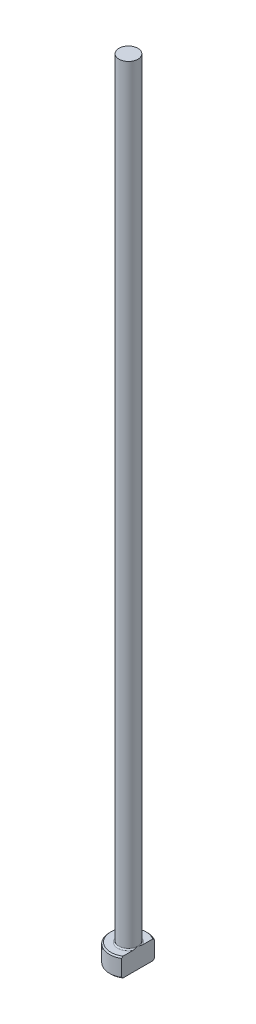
ISO-10303-21;
HEADER;
FILE_DESCRIPTION(('STEP AP214'),'2;1');
FILE_NAME('part.step','',(''),(''),'','','');
FILE_SCHEMA(('AUTOMOTIVE_DESIGN { 1 0 10303 214 1 1 1 1 }'));
ENDSEC;
DATA;
#1=APPLICATION_CONTEXT('core data for automotive mechanical design processes');
#2=APPLICATION_PROTOCOL_DEFINITION('international standard','automotive_design',2000,#1);
#3=PRODUCT_CONTEXT('',#1,'mechanical');
#4=PRODUCT('Part','Part','',(#3));
#5=PRODUCT_RELATED_PRODUCT_CATEGORY('part','',(#4));
#6=PRODUCT_DEFINITION_FORMATION('','',#4);
#7=PRODUCT_DEFINITION_CONTEXT('part definition',#1,'design');
#8=PRODUCT_DEFINITION('design','',#6,#7);
#9=PRODUCT_DEFINITION_SHAPE('','',#8);
#10=(LENGTH_UNIT() NAMED_UNIT(*) SI_UNIT(.MILLI.,.METRE.));
#11=(NAMED_UNIT(*) PLANE_ANGLE_UNIT() SI_UNIT($,.RADIAN.));
#12=(NAMED_UNIT(*) SI_UNIT($,.STERADIAN.) SOLID_ANGLE_UNIT());
#13=UNCERTAINTY_MEASURE_WITH_UNIT(LENGTH_MEASURE(1.E-05),#10,'distance_accuracy_value','');
#14=(GEOMETRIC_REPRESENTATION_CONTEXT(3) GLOBAL_UNCERTAINTY_ASSIGNED_CONTEXT((#13)) GLOBAL_UNIT_ASSIGNED_CONTEXT((#10,
#11,#12)) REPRESENTATION_CONTEXT('',''));
#15=CARTESIAN_POINT('',(0.,0.,0.));
#16=DIRECTION('',(0.,0.,1.));
#17=DIRECTION('',(1.,0.,0.));
#18=AXIS2_PLACEMENT_3D('',#15,#16,#17);
#19=CARTESIAN_POINT('',(0.,0.,0.));
#20=DIRECTION('',(0.,-1.,0.));
#21=DIRECTION('',(0.,0.,-1.));
#22=AXIS2_PLACEMENT_3D('',#19,#20,#21);
#23=PLANE('',#22);
#24=CARTESIAN_POINT('',(0.,0.,0.));
#25=DIRECTION('',(0.,-1.,0.));
#26=DIRECTION('',(0.,0.,-1.));
#27=AXIS2_PLACEMENT_3D('',#24,#25,#26);
#28=CIRCLE('',#27,2.79999999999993);
#29=CARTESIAN_POINT('',(1.49999999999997,0.,2.36431808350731));
#30=VERTEX_POINT('',#29);
#31=CARTESIAN_POINT('',(1.49999999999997,0.,-2.36431808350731));
#32=VERTEX_POINT('',#31);
#33=EDGE_CURVE('E98',#30,#32,#28,.T.);
#34=ORIENTED_EDGE('',*,*,#33,.T.);
#35=DIRECTION('',(0.,0.,1.));
#36=VECTOR('',#35,1.);
#37=CARTESIAN_POINT('',(1.49999999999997,0.,-2.5980762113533));
#38=LINE('',#37,#36);
#39=EDGE_CURVE('E83',#32,#30,#38,.T.);
#40=ORIENTED_EDGE('',*,*,#39,.T.);
#41=EDGE_LOOP('',(#34,#40));
#42=FACE_BOUND('',#41,.T.);
#43=ADVANCED_FACE('F32',(#42),#23,.T.);
#44=CARTESIAN_POINT('',(0.,259.958771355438,0.));
#45=DIRECTION('',(0.,1.,0.));
#46=DIRECTION('',(0.,0.,1.));
#47=AXIS2_PLACEMENT_3D('',#44,#45,#46);
#48=CYLINDRICAL_SURFACE('',#47,2.99999999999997);
#49=CARTESIAN_POINT('',(0.,2.80000000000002,0.));
#50=DIRECTION('',(0.,1.,0.));
#51=DIRECTION('',(0.,0.,1.));
#52=AXIS2_PLACEMENT_3D('',#49,#50,#51);
#53=CIRCLE('',#52,2.99999999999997);
#54=CARTESIAN_POINT('',(1.49999999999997,2.80000000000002,2.5980762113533));
#55=VERTEX_POINT('',#54);
#56=CARTESIAN_POINT('',(1.49999999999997,2.80000000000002,-2.5980762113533));
#57=VERTEX_POINT('',#56);
#58=EDGE_CURVE('E104',#55,#57,#53,.F.);
#59=ORIENTED_EDGE('',*,*,#58,.T.);
#60=DIRECTION('',(0.,-1.,0.));
#61=VECTOR('',#60,1.);
#62=CARTESIAN_POINT('',(1.49999999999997,125.,-2.5980762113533));
#63=LINE('',#62,#61);
#64=CARTESIAN_POINT('',(1.49999999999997,0.200000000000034,-2.5980762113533));
#65=VERTEX_POINT('',#64);
#66=EDGE_CURVE('E183',#57,#65,#63,.T.);
#67=ORIENTED_EDGE('',*,*,#66,.T.);
#68=CARTESIAN_POINT('',(0.,0.200000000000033,0.));
#69=DIRECTION('',(0.,-1.,0.));
#70=DIRECTION('',(0.,0.,-1.));
#71=AXIS2_PLACEMENT_3D('',#68,#69,#70);
#72=CIRCLE('',#71,2.99999999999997);
#73=CARTESIAN_POINT('',(1.49999999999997,0.200000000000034,2.5980762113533));
#74=VERTEX_POINT('',#73);
#75=EDGE_CURVE('E100',#65,#74,#72,.F.);
#76=ORIENTED_EDGE('',*,*,#75,.T.);
#77=DIRECTION('',(0.,-1.,0.));
#78=VECTOR('',#77,1.);
#79=CARTESIAN_POINT('',(1.49999999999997,125.,2.5980762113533));
#80=LINE('',#79,#78);
#81=EDGE_CURVE('E93',#55,#74,#80,.T.);
#82=ORIENTED_EDGE('',*,*,#81,.F.);
#83=EDGE_LOOP('',(#59,#67,#76,#82));
#84=FACE_BOUND('',#83,.T.);
#85=ADVANCED_FACE('F158',(#84),#48,.T.);
#86=CARTESIAN_POINT('',(-2.99999999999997,3.,0.));
#87=DIRECTION('',(0.,1.,0.));
#88=DIRECTION('',(0.,0.,1.));
#89=AXIS2_PLACEMENT_3D('',#86,#87,#88);
#90=PLANE('',#89);
#91=CARTESIAN_POINT('',(0.,3.,0.));
#92=DIRECTION('',(0.,1.,0.));
#93=DIRECTION('',(0.,0.,1.));
#94=AXIS2_PLACEMENT_3D('',#91,#92,#93);
#95=CIRCLE('',#94,2.79999999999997);
#96=CARTESIAN_POINT('',(1.49999999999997,3.,-2.36431808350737));
#97=VERTEX_POINT('',#96);
#98=CARTESIAN_POINT('',(1.49999999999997,3.,2.36431808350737));
#99=VERTEX_POINT('',#98);
#100=EDGE_CURVE('E178',#97,#99,#95,.T.);
#101=ORIENTED_EDGE('',*,*,#100,.T.);
#102=DIRECTION('',(0.,0.,-1.));
#103=VECTOR('',#102,1.);
#104=CARTESIAN_POINT('',(1.49999999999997,3.,0.));
#105=LINE('',#104,#103);
#106=CARTESIAN_POINT('',(1.49999999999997,2.99999999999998,0.799999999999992));
#107=VERTEX_POINT('',#106);
#108=EDGE_CURVE('E57',#99,#107,#105,.T.);
#109=ORIENTED_EDGE('',*,*,#108,.T.);
#110=CARTESIAN_POINT('',(0.,3.,0.));
#111=DIRECTION('',(0.,1.,0.));
#112=DIRECTION('',(0.,0.,1.));
#113=AXIS2_PLACEMENT_3D('',#110,#111,#112);
#114=CIRCLE('',#113,1.69999999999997);
#115=CARTESIAN_POINT('',(1.49999999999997,2.99999999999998,-0.799999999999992));
#116=VERTEX_POINT('',#115);
#117=EDGE_CURVE('E107',#107,#116,#114,.F.);
#118=ORIENTED_EDGE('',*,*,#117,.T.);
#119=EDGE_CURVE('E136',#116,#97,#105,.T.);
#120=ORIENTED_EDGE('',*,*,#119,.T.);
#121=EDGE_LOOP('',(#101,#109,#118,#120));
#122=FACE_BOUND('',#121,.T.);
#123=ADVANCED_FACE('F147',(#122),#90,.T.);
#124=CARTESIAN_POINT('',(0.,3.,0.));
#125=DIRECTION('',(0.,-1.,0.));
#126=DIRECTION('',(0.,0.,-1.));
#127=AXIS2_PLACEMENT_3D('',#124,#125,#126);
#128=CONICAL_SURFACE('',#127,2.79999999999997,0.7853981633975);
#129=ORIENTED_EDGE('',*,*,#58,.F.);
#130=CARTESIAN_POINT('',(1.49999999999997,-0.11174109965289,5.71827621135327));
#131=CARTESIAN_POINT('',(1.49999999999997,0.0136183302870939,5.58866816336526));
#132=CARTESIAN_POINT('',(1.49999999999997,0.138843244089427,5.45892957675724));
#133=CARTESIAN_POINT('',(1.49999999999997,0.388944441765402,5.19911365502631));
#134=CARTESIAN_POINT('',(1.49999999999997,0.513820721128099,5.06903631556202));
#135=CARTESIAN_POINT('',(1.49999999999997,0.763205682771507,4.8084018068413));
#136=CARTESIAN_POINT('',(1.49999999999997,0.887714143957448,4.67784442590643));
#137=CARTESIAN_POINT('',(1.49999999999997,1.13618059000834,4.41620813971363));
#138=CARTESIAN_POINT('',(1.49999999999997,1.2601385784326,4.28512923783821));
#139=CARTESIAN_POINT('',(1.49999999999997,1.50488975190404,4.02490837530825));
#140=CARTESIAN_POINT('',(1.49999999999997,1.6256969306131,3.89577958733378));
#141=CARTESIAN_POINT('',(1.49999999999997,1.86640694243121,3.63668213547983));
#142=CARTESIAN_POINT('',(1.49999999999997,1.98630978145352,3.5067134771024));
#143=CARTESIAN_POINT('',(1.49999999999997,2.22486033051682,3.24567921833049));
#144=CARTESIAN_POINT('',(1.49999999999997,2.34350830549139,3.11461386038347));
#145=CARTESIAN_POINT('',(1.49999999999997,2.57907716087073,2.85094268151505));
#146=CARTESIAN_POINT('',(1.49999999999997,2.69599811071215,2.71833692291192));
#147=CARTESIAN_POINT('',(1.49999999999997,2.88262371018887,2.50255231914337));
#148=CARTESIAN_POINT('',(1.49999999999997,2.95312454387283,2.42006293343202));
#149=CARTESIAN_POINT('',(1.49999999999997,3.09287098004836,2.25401084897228));
#150=CARTESIAN_POINT('',(1.49999999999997,3.16211645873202,2.170448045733));
#151=CARTESIAN_POINT('',(1.49999999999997,3.2996468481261,2.00105967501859));
#152=CARTESIAN_POINT('',(1.49999999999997,3.36791386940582,1.91521952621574));
#153=CARTESIAN_POINT('',(1.49999999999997,3.50205840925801,1.74171392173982));
#154=CARTESIAN_POINT('',(1.49999999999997,3.56793649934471,1.65404891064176));
#155=CARTESIAN_POINT('',(1.49999999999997,3.69728151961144,1.47490236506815));
#156=CARTESIAN_POINT('',(1.49999999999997,3.76069661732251,1.38338308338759));
#157=CARTESIAN_POINT('',(1.49999999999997,3.88239539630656,1.1967566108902));
#158=CARTESIAN_POINT('',(1.49999999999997,3.94067201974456,1.10164473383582));
#159=CARTESIAN_POINT('',(1.49999999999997,4.0484132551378,0.908008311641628));
#160=CARTESIAN_POINT('',(1.49999999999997,4.09797809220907,0.809540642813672));
#161=CARTESIAN_POINT('',(1.49999999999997,4.18432188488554,0.607192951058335));
#162=CARTESIAN_POINT('',(1.49999999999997,4.22114374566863,0.503332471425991));
#163=CARTESIAN_POINT('',(1.49999999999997,4.26099935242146,0.347577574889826));
#164=CARTESIAN_POINT('',(1.49999999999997,4.27157029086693,0.29760995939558));
#165=CARTESIAN_POINT('',(1.49999999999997,4.28794860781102,0.196885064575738));
#166=CARTESIAN_POINT('',(1.49999999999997,4.29375640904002,0.146127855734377));
#167=CARTESIAN_POINT('',(1.49999999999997,4.30019707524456,0.0444388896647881));
#168=CARTESIAN_POINT('',(1.49999999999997,4.30084594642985,-0.00649183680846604));
#169=CARTESIAN_POINT('',(1.49999999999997,4.29696416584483,-0.108155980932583));
#170=CARTESIAN_POINT('',(1.49999999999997,4.29243308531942,-0.158889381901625));
#171=CARTESIAN_POINT('',(1.49999999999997,4.27856915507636,-0.259234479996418));
#172=CARTESIAN_POINT('',(1.49999999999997,4.26927821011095,-0.308852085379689));
#173=CARTESIAN_POINT('',(1.49999999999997,4.24647108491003,-0.407110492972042));
#174=CARTESIAN_POINT('',(1.49999999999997,4.2329532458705,-0.455750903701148));
#175=CARTESIAN_POINT('',(1.49999999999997,4.20226175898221,-0.552149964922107));
#176=CARTESIAN_POINT('',(1.49999999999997,4.18506801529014,-0.599902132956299));
#177=CARTESIAN_POINT('',(1.49999999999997,4.14771387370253,-0.694205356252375));
#178=CARTESIAN_POINT('',(1.49999999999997,4.12755408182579,-0.740756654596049));
#179=CARTESIAN_POINT('',(1.49999999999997,4.06327696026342,-0.879166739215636));
#180=CARTESIAN_POINT('',(1.49999999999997,4.01551721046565,-0.969329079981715));
#181=CARTESIAN_POINT('',(1.49999999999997,3.91367909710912,-1.1460431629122));
#182=CARTESIAN_POINT('',(1.49999999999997,3.85959300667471,-1.23259031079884));
#183=CARTESIAN_POINT('',(1.49999999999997,3.74697968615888,-1.40321348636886));
#184=CARTESIAN_POINT('',(1.49999999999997,3.68843573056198,-1.48727838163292));
#185=CARTESIAN_POINT('',(1.49999999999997,3.56843845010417,-1.65322187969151));
#186=CARTESIAN_POINT('',(1.49999999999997,3.50698656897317,-1.73510153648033));
#187=CARTESIAN_POINT('',(1.49999999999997,3.38115673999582,-1.89829823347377));
#188=CARTESIAN_POINT('',(1.49999999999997,3.31675092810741,-1.9795936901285));
#189=CARTESIAN_POINT('',(1.49999999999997,3.18634068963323,-2.14090082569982));
#190=CARTESIAN_POINT('',(1.49999999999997,3.12033609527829,-2.22091236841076));
#191=CARTESIAN_POINT('',(1.49999999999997,2.9208643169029,-2.4590650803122));
#192=CARTESIAN_POINT('',(1.49999999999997,2.78562663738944,-2.6157209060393));
#193=CARTESIAN_POINT('',(1.49999999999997,2.53554498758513,-2.90006295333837));
#194=CARTESIAN_POINT('',(1.49999999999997,2.421145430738,-3.02814382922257));
#195=CARTESIAN_POINT('',(1.49999999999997,2.19093557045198,-3.28303767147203));
#196=CARTESIAN_POINT('',(1.49999999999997,2.07512522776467,-3.40985060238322));
#197=CARTESIAN_POINT('',(1.49999999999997,1.72597067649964,-3.78913849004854));
#198=CARTESIAN_POINT('',(1.49999999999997,1.49111760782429,-4.04022177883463));
#199=CARTESIAN_POINT('',(1.49999999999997,1.02882478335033,-4.52992803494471));
#200=CARTESIAN_POINT('',(1.49999999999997,0.801477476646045,-4.76863870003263));
#201=CARTESIAN_POINT('',(1.49999999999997,0.459548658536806,-5.12558036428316));
#202=CARTESIAN_POINT('',(1.49999999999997,0.345484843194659,-5.24430773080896));
#203=CARTESIAN_POINT('',(1.49999999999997,0.117071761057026,-5.48148573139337));
#204=CARTESIAN_POINT('',(1.49999999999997,0.00272249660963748,-5.59993636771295));
#205=CARTESIAN_POINT('',(1.49999999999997,-0.111741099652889,-5.71827621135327));
#206=B_SPLINE_CURVE_WITH_KNOTS('',3,(#130,#131,#132,#133,#134,#135,#136,#137,#138,#139,#140,
#141,#142,#143,#144,#145,#146,#147,#148,#149,#150,#151,#152,#153,#154,#155,#156,#157,#158,#159,
#160,#161,#162,#163,#164,#165,#166,#167,#168,#169,#170,#171,#172,#173,#174,#175,#176,#177,#178,
#179,#180,#181,#182,#183,#184,#185,#186,#187,#188,#189,#190,#191,#192,#193,#194,#195,#196,#197,
#198,#199,#200,#201,#202,#203,#204,#205),.UNSPECIFIED.,.F.,.F.,(4,2,2,2,2,2,2,2,2,2,2,2,2,2,2,2,
2,2,2,2,2,2,2,2,2,2,2,2,2,2,2,2,2,2,2,2,2,4),(0.,0.540943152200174,1.08189327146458,
1.62312052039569,2.16434426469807,2.69482920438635,3.22531067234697,3.75567781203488,
4.28602356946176,4.61155053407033,4.93710943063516,5.26610945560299,5.59503024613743,
5.92894782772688,6.26331713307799,6.59354403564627,6.92264800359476,7.07567478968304,
7.22868799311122,7.38122626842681,7.53377717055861,7.68500755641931,7.83629736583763,
7.98843643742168,8.14054446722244,8.4461879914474,8.75220879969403,9.05944044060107,
9.366521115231,9.677642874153,9.98879742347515,10.6095925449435,11.1247803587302,
11.6399825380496,12.6713544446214,13.6603005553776,14.1542238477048,14.648143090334),.UNSPECIFIED.);
#207=EDGE_CURVE('E135',#55,#99,#206,.T.);
#208=ORIENTED_EDGE('',*,*,#207,.T.);
#209=ORIENTED_EDGE('',*,*,#100,.F.);
#210=EDGE_CURVE('E127',#97,#57,#206,.T.);
#211=ORIENTED_EDGE('',*,*,#210,.T.);
#212=EDGE_LOOP('',(#129,#208,#209,#211));
#213=FACE_BOUND('',#212,.T.);
#214=ADVANCED_FACE('F143',(#213),#128,.T.);
#215=CARTESIAN_POINT('',(0.,0.200000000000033,0.));
#216=DIRECTION('',(0.,1.,0.));
#217=DIRECTION('',(0.,0.,1.));
#218=AXIS2_PLACEMENT_3D('',#215,#216,#217);
#219=CONICAL_SURFACE('',#218,2.99999999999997,0.785398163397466);
#220=ORIENTED_EDGE('',*,*,#75,.F.);
#221=CARTESIAN_POINT('',(1.49999999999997,3.11174109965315,-5.71827621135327));
#222=CARTESIAN_POINT('',(1.49999999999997,2.98638166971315,-5.58866816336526));
#223=CARTESIAN_POINT('',(1.49999999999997,2.8611567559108,-5.45892957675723));
#224=CARTESIAN_POINT('',(1.49999999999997,2.6110555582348,-5.19911365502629));
#225=CARTESIAN_POINT('',(1.49999999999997,2.48617927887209,-5.06903631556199));
#226=CARTESIAN_POINT('',(1.49999999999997,2.23679431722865,-4.80840180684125));
#227=CARTESIAN_POINT('',(1.49999999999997,2.11228585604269,-4.67784442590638));
#228=CARTESIAN_POINT('',(1.49999999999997,1.86381940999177,-4.41620813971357));
#229=CARTESIAN_POINT('',(1.49999999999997,1.7398614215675,-4.28512923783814));
#230=CARTESIAN_POINT('',(1.49999999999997,1.49511024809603,-4.02490837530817));
#231=CARTESIAN_POINT('',(1.49999999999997,1.37430306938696,-3.89577958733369));
#232=CARTESIAN_POINT('',(1.49999999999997,1.13359305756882,-3.63668213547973));
#233=CARTESIAN_POINT('',(1.49999999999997,1.0136902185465,-3.50671347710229));
#234=CARTESIAN_POINT('',(1.49999999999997,0.775139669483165,-3.24567921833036));
#235=CARTESIAN_POINT('',(1.49999999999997,0.656491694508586,-3.11461386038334));
#236=CARTESIAN_POINT('',(1.49999999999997,0.420922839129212,-2.85094268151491));
#237=CARTESIAN_POINT('',(1.49999999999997,0.304001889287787,-2.71833692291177));
#238=CARTESIAN_POINT('',(1.49999999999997,0.117376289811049,-2.50255231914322));
#239=CARTESIAN_POINT('',(1.49999999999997,0.0468754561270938,-2.42006293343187));
#240=CARTESIAN_POINT('',(1.49999999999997,-0.0928709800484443,-2.25401084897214));
#241=CARTESIAN_POINT('',(1.49999999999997,-0.162116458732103,-2.17044804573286));
#242=CARTESIAN_POINT('',(1.49999999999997,-0.299646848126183,-2.00105967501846));
#243=CARTESIAN_POINT('',(1.49999999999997,-0.367913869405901,-1.91521952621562));
#244=CARTESIAN_POINT('',(1.49999999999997,-0.502058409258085,-1.74171392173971));
#245=CARTESIAN_POINT('',(1.49999999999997,-0.567936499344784,-1.65404891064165));
#246=CARTESIAN_POINT('',(1.49999999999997,-0.697281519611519,-1.47490236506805));
#247=CARTESIAN_POINT('',(1.49999999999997,-0.760696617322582,-1.38338308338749));
#248=CARTESIAN_POINT('',(1.49999999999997,-0.882395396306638,-1.19675661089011));
#249=CARTESIAN_POINT('',(1.49999999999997,-0.940672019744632,-1.10164473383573));
#250=CARTESIAN_POINT('',(1.49999999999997,-1.04841325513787,-0.908008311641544));
#251=CARTESIAN_POINT('',(1.49999999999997,-1.09797809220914,-0.809540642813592));
#252=CARTESIAN_POINT('',(1.49999999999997,-1.1843218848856,-0.60719295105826));
#253=CARTESIAN_POINT('',(1.49999999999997,-1.22114374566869,-0.503332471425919));
#254=CARTESIAN_POINT('',(1.49999999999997,-1.26099935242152,-0.347577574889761));
#255=CARTESIAN_POINT('',(1.49999999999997,-1.27157029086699,-0.29760995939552));
#256=CARTESIAN_POINT('',(1.49999999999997,-1.28794860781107,-0.196885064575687));
#257=CARTESIAN_POINT('',(1.49999999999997,-1.29375640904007,-0.146127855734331));
#258=CARTESIAN_POINT('',(1.49999999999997,-1.30019707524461,-0.0444388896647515));
#259=CARTESIAN_POINT('',(1.49999999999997,-1.3008459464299,0.00649183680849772));
#260=CARTESIAN_POINT('',(1.49999999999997,-1.29696416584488,0.108155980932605));
#261=CARTESIAN_POINT('',(1.49999999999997,-1.29243308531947,0.158889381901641));
#262=CARTESIAN_POINT('',(1.49999999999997,-1.2785691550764,0.259234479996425));
#263=CARTESIAN_POINT('',(1.49999999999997,-1.26927821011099,0.308852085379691));
#264=CARTESIAN_POINT('',(1.49999999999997,-1.24647108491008,0.407110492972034));
#265=CARTESIAN_POINT('',(1.49999999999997,-1.23295324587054,0.455750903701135));
#266=CARTESIAN_POINT('',(1.49999999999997,-1.20226175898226,0.552149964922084));
#267=CARTESIAN_POINT('',(1.49999999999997,-1.18506801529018,0.599902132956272));
#268=CARTESIAN_POINT('',(1.49999999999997,-1.14771387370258,0.694205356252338));
#269=CARTESIAN_POINT('',(1.49999999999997,-1.12755408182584,0.740756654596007));
#270=CARTESIAN_POINT('',(1.49999999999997,-1.06327696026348,0.879166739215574));
#271=CARTESIAN_POINT('',(1.49999999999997,-1.01551721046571,0.969329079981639));
#272=CARTESIAN_POINT('',(1.49999999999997,-0.913679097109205,1.1460431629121));
#273=CARTESIAN_POINT('',(1.49999999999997,-0.8595930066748,1.23259031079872));
#274=CARTESIAN_POINT('',(1.49999999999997,-0.746979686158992,1.40321348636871));
#275=CARTESIAN_POINT('',(1.49999999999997,-0.688435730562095,1.48727838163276));
#276=CARTESIAN_POINT('',(1.49999999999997,-0.568438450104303,1.65322187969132));
#277=CARTESIAN_POINT('',(1.49999999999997,-0.506986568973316,1.73510153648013));
#278=CARTESIAN_POINT('',(1.49999999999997,-0.381156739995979,1.89829823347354));
#279=CARTESIAN_POINT('',(1.49999999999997,-0.316750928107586,1.97959369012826));
#280=CARTESIAN_POINT('',(1.49999999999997,-0.186340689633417,2.14090082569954));
#281=CARTESIAN_POINT('',(1.49999999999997,-0.120336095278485,2.22091236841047));
#282=CARTESIAN_POINT('',(1.49999999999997,0.0791356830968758,2.45906508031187));
#283=CARTESIAN_POINT('',(1.49999999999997,0.214373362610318,2.61572090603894));
#284=CARTESIAN_POINT('',(1.49999999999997,0.46445501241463,2.90006295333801));
#285=CARTESIAN_POINT('',(1.49999999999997,0.578854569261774,3.02814382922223));
#286=CARTESIAN_POINT('',(1.49999999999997,0.809064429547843,3.28303767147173));
#287=CARTESIAN_POINT('',(1.49999999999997,0.924874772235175,3.40985060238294));
#288=CARTESIAN_POINT('',(1.49999999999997,1.27402932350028,3.78913849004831));
#289=CARTESIAN_POINT('',(1.49999999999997,1.50888239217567,4.04022177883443));
#290=CARTESIAN_POINT('',(1.49999999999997,1.97117521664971,4.52992803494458));
#291=CARTESIAN_POINT('',(1.49999999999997,2.19852252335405,4.76863870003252));
#292=CARTESIAN_POINT('',(1.49999999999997,2.54045134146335,5.12558036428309));
#293=CARTESIAN_POINT('',(1.49999999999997,2.65451515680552,5.2443077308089));
#294=CARTESIAN_POINT('',(1.49999999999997,2.88292823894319,5.48148573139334));
#295=CARTESIAN_POINT('',(1.49999999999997,2.9972775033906,5.59993636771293));
#296=CARTESIAN_POINT('',(1.49999999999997,3.11174109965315,5.71827621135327));
#297=B_SPLINE_CURVE_WITH_KNOTS('',3,(#221,#222,#223,#224,#225,#226,#227,#228,#229,#230,#231,
#232,#233,#234,#235,#236,#237,#238,#239,#240,#241,#242,#243,#244,#245,#246,#247,#248,#249,#250,
#251,#252,#253,#254,#255,#256,#257,#258,#259,#260,#261,#262,#263,#264,#265,#266,#267,#268,#269,
#270,#271,#272,#273,#274,#275,#276,#277,#278,#279,#280,#281,#282,#283,#284,#285,#286,#287,#288,
#289,#290,#291,#292,#293,#294,#295,#296),.UNSPECIFIED.,.F.,.F.,(4,2,2,2,2,2,2,2,2,2,2,2,2,2,2,2,
2,2,2,2,2,2,2,2,2,2,2,2,2,2,2,2,2,2,2,2,2,4),(0.,0.540943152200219,1.08189327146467,
1.62312052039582,2.16434426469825,2.69482920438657,3.22531067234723,3.75567781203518,
4.28602356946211,4.61155053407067,4.93710943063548,5.2661094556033,5.59503024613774,
5.92894782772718,6.26331713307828,6.59354403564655,6.92264800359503,7.0756747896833,
7.22868799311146,7.38122626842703,7.53377717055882,7.68500755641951,7.83629736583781,
7.98843643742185,8.14054446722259,8.4461879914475,8.75220879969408,9.05944044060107,
9.36652111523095,9.6776428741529,9.98879742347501,10.6095925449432,11.1247803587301,
11.6399825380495,12.6713544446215,13.6603005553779,14.1542238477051,14.6481430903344),.UNSPECIFIED.);
#298=EDGE_CURVE('E86',#65,#32,#297,.T.);
#299=ORIENTED_EDGE('',*,*,#298,.T.);
#300=ORIENTED_EDGE('',*,*,#33,.F.);
#301=EDGE_CURVE('E89',#30,#74,#297,.T.);
#302=ORIENTED_EDGE('',*,*,#301,.T.);
#303=EDGE_LOOP('',(#220,#299,#300,#302));
#304=FACE_BOUND('',#303,.T.);
#305=ADVANCED_FACE('F97',(#304),#219,.T.);
#306=CARTESIAN_POINT('',(0.,3.19999999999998,0.));
#307=DIRECTION('',(0.,1.,0.));
#308=DIRECTION('',(0.,0.,1.));
#309=AXIS2_PLACEMENT_3D('',#306,#307,#308);
#310=TOROIDAL_SURFACE('',#309,1.69999999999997,0.2);
#311=CARTESIAN_POINT('',(1.49999999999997,3.19999999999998,0.));
#312=CARTESIAN_POINT('',(1.49999999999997,3.20000050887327,7.14686524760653E-11));
#313=CARTESIAN_POINT('',(1.49999999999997,3.20000101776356,-1.21663671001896E-07));
#314=CARTESIAN_POINT('',(1.49999999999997,3.20000199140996,-4.97616231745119E-07));
#315=CARTESIAN_POINT('',(1.49999999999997,3.20000245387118,-7.56516213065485E-07));
#316=CARTESIAN_POINT('',(1.49999999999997,3.20000338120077,-1.37642836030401E-06));
#317=CARTESIAN_POINT('',(1.49999999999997,3.20000384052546,-1.74563475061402E-06));
#318=CARTESIAN_POINT('',(1.49999999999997,3.20000469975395,-2.53565983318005E-06));
#319=CARTESIAN_POINT('',(1.49999999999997,3.20000510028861,-2.95582595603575E-06));
#320=CARTESIAN_POINT('',(1.49999999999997,3.20000646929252,-4.48430443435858E-06));
#321=CARTESIAN_POINT('',(1.49999999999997,3.20000736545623,-5.6586103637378E-06));
#322=CARTESIAN_POINT('',(1.49999999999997,3.20000893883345,-8.06479198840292E-06));
#323=CARTESIAN_POINT('',(1.49999999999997,3.20000962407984,-9.29170513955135E-06));
#324=CARTESIAN_POINT('',(1.49999999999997,3.2000122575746,-1.41623288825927E-05));
#325=CARTESIAN_POINT('',(1.49999999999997,3.20001407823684,-1.78790031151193E-05));
#326=CARTESIAN_POINT('',(1.49999999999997,3.20001699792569,-2.51443065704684E-05));
#327=CARTESIAN_POINT('',(1.49999999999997,3.20001815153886,-2.86715393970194E-05));
#328=CARTESIAN_POINT('',(1.49999999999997,3.20002315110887,-4.39218127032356E-05));
#329=CARTESIAN_POINT('',(1.49999999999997,3.2000270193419,-5.56288388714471E-05));
#330=CARTESIAN_POINT('',(1.49999999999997,3.20003312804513,-7.74058287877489E-05));
#331=CARTESIAN_POINT('',(1.49999999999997,3.20003553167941,-8.7427840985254E-05));
#332=CARTESIAN_POINT('',(1.49999999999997,3.20005483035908,-0.00016122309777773));
#333=CARTESIAN_POINT('',(1.49999999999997,3.2000797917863,-0.000222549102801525));
#334=CARTESIAN_POINT('',(1.49999999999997,3.20017391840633,-0.000462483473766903));
#335=CARTESIAN_POINT('',(1.49999999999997,3.20023706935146,-0.000642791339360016));
#336=CARTESIAN_POINT('',(1.49999999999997,3.20048761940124,-0.00134785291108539));
#337=CARTESIAN_POINT('',(1.49999999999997,3.20068132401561,-0.00187087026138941));
#338=CARTESIAN_POINT('',(1.49999999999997,3.20147357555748,-0.0040200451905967));
#339=CARTESIAN_POINT('',(1.49999999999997,3.20206499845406,-0.00564811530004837));
#340=CARTESIAN_POINT('',(1.49999999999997,3.2089263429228,-0.0245232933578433));
#341=CARTESIAN_POINT('',(1.49999999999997,3.21523683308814,-0.0417598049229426));
#342=CARTESIAN_POINT('',(1.49999999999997,3.22755028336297,-0.0756091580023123));
#343=CARTESIAN_POINT('',(1.49999999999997,3.23355589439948,-0.0922211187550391));
#344=CARTESIAN_POINT('',(1.49999999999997,3.2462010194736,-0.127454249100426));
#345=CARTESIAN_POINT('',(1.49999999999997,3.25283080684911,-0.146078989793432));
#346=CARTESIAN_POINT('',(1.49999999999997,3.26599765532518,-0.183577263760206));
#347=CARTESIAN_POINT('',(1.49999999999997,3.2725330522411,-0.202451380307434));
#348=CARTESIAN_POINT('',(1.49999999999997,3.28834228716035,-0.248982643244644));
#349=CARTESIAN_POINT('',(1.49999999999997,3.29749152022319,-0.276682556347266));
#350=CARTESIAN_POINT('',(1.49999999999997,3.3149093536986,-0.331625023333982));
#351=CARTESIAN_POINT('',(1.49999999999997,3.32319386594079,-0.358862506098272));
#352=CARTESIAN_POINT('',(1.49999999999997,3.34051594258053,-0.419125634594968));
#353=CARTESIAN_POINT('',(1.49999999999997,3.34936607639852,-0.452206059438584));
#354=CARTESIAN_POINT('',(1.49999999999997,3.36549583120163,-0.519023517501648));
#355=CARTESIAN_POINT('',(1.49999999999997,3.37276283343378,-0.552763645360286));
#356=CARTESIAN_POINT('',(1.49999999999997,3.38554755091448,-0.623053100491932));
#357=CARTESIAN_POINT('',(1.49999999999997,3.39090573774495,-0.659632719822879));
#358=CARTESIAN_POINT('',(1.49999999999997,3.39825016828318,-0.733028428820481));
#359=CARTESIAN_POINT('',(1.49999999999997,3.40024734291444,-0.769843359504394));
#360=CARTESIAN_POINT('',(1.49999999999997,3.39970780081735,-0.842856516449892));
#361=CARTESIAN_POINT('',(1.49999999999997,3.39725347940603,-0.87905368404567));
#362=CARTESIAN_POINT('',(1.49999999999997,3.38900085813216,-0.932380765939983));
#363=CARTESIAN_POINT('',(1.49999999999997,3.38553049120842,-0.949868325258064));
#364=CARTESIAN_POINT('',(1.49999999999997,3.37678336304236,-0.98437493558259));
#365=CARTESIAN_POINT('',(1.49999999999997,3.37150943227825,-1.00139467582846));
#366=CARTESIAN_POINT('',(1.49999999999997,3.35869781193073,-1.03479423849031));
#367=CARTESIAN_POINT('',(1.49999999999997,3.3511359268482,-1.05116499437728));
#368=CARTESIAN_POINT('',(1.49999999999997,3.33325333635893,-1.08234828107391));
#369=CARTESIAN_POINT('',(1.49999999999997,3.32294266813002,-1.097166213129));
#370=CARTESIAN_POINT('',(1.49999999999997,3.30512758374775,-1.11714173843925));
#371=CARTESIAN_POINT('',(1.49999999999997,3.29884721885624,-1.1233906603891));
#372=CARTESIAN_POINT('',(1.49999999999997,3.28545950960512,-1.13494695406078));
#373=CARTESIAN_POINT('',(1.49999999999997,3.27835226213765,-1.14025443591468));
#374=CARTESIAN_POINT('',(1.49999999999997,3.26325970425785,-1.14967631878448));
#375=CARTESIAN_POINT('',(1.49999999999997,3.25526534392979,-1.1537764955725));
#376=CARTESIAN_POINT('',(1.49999999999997,3.23863207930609,-1.16034952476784));
#377=CARTESIAN_POINT('',(1.49999999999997,3.22999427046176,-1.16282507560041));
#378=CARTESIAN_POINT('',(1.49999999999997,3.21343922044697,-1.16570267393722));
#379=CARTESIAN_POINT('',(1.49999999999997,3.20555896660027,-1.16631687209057));
#380=CARTESIAN_POINT('',(1.49999999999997,3.18982775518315,-1.16602054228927));
#381=CARTESIAN_POINT('',(1.49999999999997,3.18197679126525,-1.16511036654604));
#382=CARTESIAN_POINT('',(1.49999999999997,3.16747846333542,-1.16204446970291));
#383=CARTESIAN_POINT('',(1.49999999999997,3.16079696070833,-1.16004509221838));
#384=CARTESIAN_POINT('',(1.49999999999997,3.14781700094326,-1.15505972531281));
#385=CARTESIAN_POINT('',(1.49999999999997,3.14151862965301,-1.1520735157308));
#386=CARTESIAN_POINT('',(1.49999999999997,3.12690214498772,-1.14387585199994));
#387=CARTESIAN_POINT('',(1.49999999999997,3.11881436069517,-1.13825400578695));
#388=CARTESIAN_POINT('',(1.49999999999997,3.1036444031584,-1.12578441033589));
#389=CARTESIAN_POINT('',(1.49999999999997,3.09656475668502,-1.11893367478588));
#390=CARTESIAN_POINT('',(1.49999999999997,3.08012297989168,-1.10074342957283));
#391=CARTESIAN_POINT('',(1.49999999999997,3.07136543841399,-1.08886044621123));
#392=CARTESIAN_POINT('',(1.49999999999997,3.05578194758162,-1.06392743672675));
#393=CARTESIAN_POINT('',(1.49999999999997,3.0489571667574,-1.05087671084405));
#394=CARTESIAN_POINT('',(1.49999999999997,3.03273856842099,-1.0147230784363));
#395=CARTESIAN_POINT('',(1.49999999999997,3.02486230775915,-0.990945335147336));
#396=CARTESIAN_POINT('',(1.49999999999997,3.01257693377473,-0.942321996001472));
#397=CARTESIAN_POINT('',(1.49999999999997,3.00820590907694,-0.917467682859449));
#398=CARTESIAN_POINT('',(1.49999999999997,3.00229956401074,-0.867912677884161));
#399=CARTESIAN_POINT('',(1.49999999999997,3.0007128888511,-0.843217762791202));
#400=CARTESIAN_POINT('',(1.49999999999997,2.9996723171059,-0.793746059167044));
#401=CARTESIAN_POINT('',(1.49999999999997,3.0002230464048,-0.768969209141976));
#402=CARTESIAN_POINT('',(1.49999999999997,3.00433101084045,-0.696994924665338));
#403=CARTESIAN_POINT('',(1.49999999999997,3.01016976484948,-0.649931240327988));
#404=CARTESIAN_POINT('',(1.49999999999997,3.02567776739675,-0.559166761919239));
#405=CARTESIAN_POINT('',(1.49999999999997,3.03511950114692,-0.515423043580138));
#406=CARTESIAN_POINT('',(1.49999999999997,3.05693059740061,-0.427590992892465));
#407=CARTESIAN_POINT('',(1.49999999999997,3.0693635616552,-0.383518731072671));
#408=CARTESIAN_POINT('',(1.49999999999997,3.0917495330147,-0.310161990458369));
#409=CARTESIAN_POINT('',(1.49999999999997,3.1011984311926,-0.280718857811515));
#410=CARTESIAN_POINT('',(1.49999999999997,3.12060442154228,-0.22234098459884));
#411=CARTESIAN_POINT('',(1.49999999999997,3.13055519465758,-0.193404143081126));
#412=CARTESIAN_POINT('',(1.49999999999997,3.14973721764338,-0.1387568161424));
#413=CARTESIAN_POINT('',(1.49999999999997,3.15893123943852,-0.113033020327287));
#414=CARTESIAN_POINT('',(1.49999999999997,3.17788037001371,-0.0606351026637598));
#415=CARTESIAN_POINT('',(1.49999999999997,3.18764328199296,-0.0339636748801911));
#416=CARTESIAN_POINT('',(1.49999999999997,3.19793548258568,-0.00564657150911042));
#417=CARTESIAN_POINT('',(1.49999999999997,3.19852751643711,-0.00401699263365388));
#418=CARTESIAN_POINT('',(1.49999999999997,3.1993199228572,-0.00186745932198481));
#419=CARTESIAN_POINT('',(1.49999999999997,3.1995131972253,-0.00134559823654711));
#420=CARTESIAN_POINT('',(1.49999999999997,3.19976322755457,-0.000641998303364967));
#421=CARTESIAN_POINT('',(1.49999999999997,3.19982627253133,-0.000461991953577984));
#422=CARTESIAN_POINT('',(1.49999999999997,3.19992025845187,-0.000222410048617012));
#423=CARTESIAN_POINT('',(1.49999999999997,3.19994519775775,-0.000161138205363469));
#424=CARTESIAN_POINT('',(1.49999999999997,3.1999644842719,-8.74039265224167E-05));
#425=CARTESIAN_POINT('',(1.49999999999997,3.19996688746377,-7.73857554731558E-05));
#426=CARTESIAN_POINT('',(1.49999999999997,3.19997299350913,-5.56173270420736E-05));
#427=CARTESIAN_POINT('',(1.49999999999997,3.19997685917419,-4.39149185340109E-05));
#428=CARTESIAN_POINT('',(1.49999999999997,3.19998185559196,-2.86698156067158E-05));
#429=CARTESIAN_POINT('',(1.49999999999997,3.19998300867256,-2.51431574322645E-05));
#430=CARTESIAN_POINT('',(1.49999999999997,3.19998592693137,-1.78789551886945E-05));
#431=CARTESIAN_POINT('',(1.49999999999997,3.19998774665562,-1.41627846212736E-05));
#432=CARTESIAN_POINT('',(1.49999999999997,3.1999903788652,-9.29264485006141E-06));
#433=CARTESIAN_POINT('',(1.49999999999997,3.19999106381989,-8.06577596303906E-06));
#434=CARTESIAN_POINT('',(1.49999999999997,3.19999263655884,-5.65962636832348E-06));
#435=CARTESIAN_POINT('',(1.49999999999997,3.19999353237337,-4.48530463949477E-06));
#436=CARTESIAN_POINT('',(1.49999999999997,3.19999490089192,-2.95673739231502E-06));
#437=CARTESIAN_POINT('',(1.49999999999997,3.19999530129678,-2.53653206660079E-06));
#438=CARTESIAN_POINT('',(1.49999999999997,3.19999616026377,-1.74640524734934E-06));
#439=CARTESIAN_POINT('',(1.49999999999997,3.19999661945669,-1.37713597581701E-06));
#440=CARTESIAN_POINT('',(1.49999999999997,3.19999754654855,-7.57072329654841E-07));
#441=CARTESIAN_POINT('',(1.49999999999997,3.1999980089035,-4.98087382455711E-07));
#442=CARTESIAN_POINT('',(1.49999999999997,3.19999898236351,-1.21927247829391E-07));
#443=CARTESIAN_POINT('',(1.49999999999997,3.19999949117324,-7.14621145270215E-11));
#444=CARTESIAN_POINT('',(1.49999999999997,3.19999999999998,0.));
#445=B_SPLINE_CURVE_WITH_KNOTS('',3,(#311,#312,#313,#314,#315,#316,#317,#318,#319,#320,#321,
#322,#323,#324,#325,#326,#327,#328,#329,#330,#331,#332,#333,#334,#335,#336,#337,#338,#339,#340,
#341,#342,#343,#344,#345,#346,#347,#348,#349,#350,#351,#352,#353,#354,#355,#356,#357,#358,#359,
#360,#361,#362,#363,#364,#365,#366,#367,#368,#369,#370,#371,#372,#373,#374,#375,#376,#377,#378,
#379,#380,#381,#382,#383,#384,#385,#386,#387,#388,#389,#390,#391,#392,#393,#394,#395,#396,#397,
#398,#399,#400,#401,#402,#403,#404,#405,#406,#407,#408,#409,#410,#411,#412,#413,#414,#415,#416,
#417,#418,#419,#420,#421,#422,#423,#424,#425,#426,#427,#428,#429,#430,#431,#432,#433,#434,#435,
#436,#437,#438,#439,#440,#441,#442,#443,#444),.UNSPECIFIED.,.T.,.F.,(4,2,2,2,2,2,2,2,2,2,2,2,2,
2,2,2,2,2,2,2,2,2,2,2,2,2,2,2,2,2,2,2,2,2,2,2,2,2,2,2,2,2,2,2,2,2,2,2,2,2,2,2,2,2,2,2,2,2,2,2,2,
2,2,2,2,2,4),(0.,1.5268750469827E-06,3.1095939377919E-06,4.8697676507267E-06,
6.6094009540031E-06,1.1020252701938E-05,1.52327800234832E-05,2.76140373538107E-05,
3.87351647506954E-05,7.57188333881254E-05,0.000106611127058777,0.000304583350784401,
0.000878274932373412,0.00255078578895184,0.00774802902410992,0.0628090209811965,
0.115802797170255,0.175110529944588,0.235030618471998,0.322539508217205,0.407938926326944,
0.510638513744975,0.614128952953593,0.724918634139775,0.835347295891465,0.943752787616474,
0.997165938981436,1.05049564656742,1.10441029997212,1.1581307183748,1.18463966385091,
1.21114550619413,1.23795217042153,1.26471419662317,1.28828324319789,1.31184684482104,
1.33268332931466,1.35352446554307,1.38290826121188,1.41236445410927,1.45639976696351,
1.5004616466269,1.5751878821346,1.65071550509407,1.72483484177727,1.79911468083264,
1.94105061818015,2.07520625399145,2.21251544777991,2.30527614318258,2.3970705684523,
2.47902409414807,2.56422207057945,2.56942417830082,2.57109299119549,2.57166572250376,
2.57186352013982,2.57189440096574,2.57193136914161,2.5719424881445,2.5719548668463,
2.57195907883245,2.5719634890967,2.571965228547,2.57196698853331,2.5719685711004,
2.57197009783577),.UNSPECIFIED.);
#446=CARTESIAN_POINT('',(1.49999999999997,3.19999999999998,0.));
#447=VERTEX_POINT('',#446);
#448=EDGE_CURVE('E11',#116,#447,#445,.T.);
#449=ORIENTED_EDGE('',*,*,#448,.F.);
#450=ORIENTED_EDGE('',*,*,#117,.F.);
#451=CARTESIAN_POINT('',(1.49999999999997,3.19999999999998,0.));
#452=CARTESIAN_POINT('',(1.49999999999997,3.19999949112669,-7.14686931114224E-11));
#453=CARTESIAN_POINT('',(1.49999999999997,3.1999989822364,1.21663670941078E-07));
#454=CARTESIAN_POINT('',(1.49999999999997,3.19999800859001,4.97616231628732E-07));
#455=CARTESIAN_POINT('',(1.49999999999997,3.19999754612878,7.56516212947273E-07));
#456=CARTESIAN_POINT('',(1.49999999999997,3.19999661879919,1.37642836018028E-06));
#457=CARTESIAN_POINT('',(1.49999999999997,3.1999961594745,1.74563475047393E-06));
#458=CARTESIAN_POINT('',(1.49999999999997,3.19999530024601,2.53565983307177E-06));
#459=CARTESIAN_POINT('',(1.49999999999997,3.19999489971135,2.95582595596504E-06));
#460=CARTESIAN_POINT('',(1.49999999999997,3.19999353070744,4.48430443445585E-06));
#461=CARTESIAN_POINT('',(1.49999999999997,3.19999263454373,5.65861036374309E-06));
#462=CARTESIAN_POINT('',(1.49999999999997,3.19999106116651,8.06479198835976E-06));
#463=CARTESIAN_POINT('',(1.49999999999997,3.19999037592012,9.29170513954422E-06));
#464=CARTESIAN_POINT('',(1.49999999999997,3.19998774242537,1.41623288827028E-05));
#465=CARTESIAN_POINT('',(1.49999999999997,3.19998592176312,1.78790031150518E-05));
#466=CARTESIAN_POINT('',(1.49999999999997,3.19998300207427,2.51443065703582E-05));
#467=CARTESIAN_POINT('',(1.49999999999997,3.1999818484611,2.86715393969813E-05));
#468=CARTESIAN_POINT('',(1.49999999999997,3.19997684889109,4.39218127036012E-05));
#469=CARTESIAN_POINT('',(1.49999999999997,3.19997298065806,5.56288388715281E-05));
#470=CARTESIAN_POINT('',(1.49999999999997,3.19996687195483,7.7405828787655E-05));
#471=CARTESIAN_POINT('',(1.49999999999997,3.19996446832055,8.74278409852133E-05));
#472=CARTESIAN_POINT('',(1.49999999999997,3.19994516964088,0.000161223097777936));
#473=CARTESIAN_POINT('',(1.49999999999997,3.19992020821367,0.00022254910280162));
#474=CARTESIAN_POINT('',(1.49999999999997,3.19982608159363,0.000462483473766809));
#475=CARTESIAN_POINT('',(1.49999999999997,3.1997629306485,0.000642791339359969));
#476=CARTESIAN_POINT('',(1.49999999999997,3.19951238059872,0.00134785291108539));
#477=CARTESIAN_POINT('',(1.49999999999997,3.19931867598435,0.00187087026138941));
#478=CARTESIAN_POINT('',(1.49999999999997,3.19852642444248,0.0040200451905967));
#479=CARTESIAN_POINT('',(1.49999999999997,3.19793500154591,0.00564811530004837));
#480=CARTESIAN_POINT('',(1.49999999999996,3.19107365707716,0.0245232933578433));
#481=CARTESIAN_POINT('',(1.49999999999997,3.18476316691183,0.0417598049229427));
#482=CARTESIAN_POINT('',(1.49999999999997,3.17244971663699,0.0756091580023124));
#483=CARTESIAN_POINT('',(1.49999999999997,3.16644410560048,0.0922211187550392));
#484=CARTESIAN_POINT('',(1.49999999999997,3.15379898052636,0.127454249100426));
#485=CARTESIAN_POINT('',(1.49999999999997,3.14716919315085,0.146078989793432));
#486=CARTESIAN_POINT('',(1.49999999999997,3.13400234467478,0.183577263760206));
#487=CARTESIAN_POINT('',(1.49999999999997,3.12746694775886,0.202451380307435));
#488=CARTESIAN_POINT('',(1.49999999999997,3.11165771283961,0.248982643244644));
#489=CARTESIAN_POINT('',(1.49999999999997,3.10250847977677,0.276682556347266));
#490=CARTESIAN_POINT('',(1.49999999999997,3.08509064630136,0.331625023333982));
#491=CARTESIAN_POINT('',(1.49999999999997,3.07680613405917,0.358862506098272));
#492=CARTESIAN_POINT('',(1.49999999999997,3.05948405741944,0.419125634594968));
#493=CARTESIAN_POINT('',(1.49999999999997,3.05063392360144,0.452206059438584));
#494=CARTESIAN_POINT('',(1.49999999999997,3.03450416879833,0.519023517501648));
#495=CARTESIAN_POINT('',(1.49999999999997,3.02723716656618,0.552763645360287));
#496=CARTESIAN_POINT('',(1.49999999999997,3.01445244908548,0.623053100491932));
#497=CARTESIAN_POINT('',(1.49999999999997,3.00909426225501,0.659632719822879));
#498=CARTESIAN_POINT('',(1.49999999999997,3.00174983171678,0.733028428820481));
#499=CARTESIAN_POINT('',(1.49999999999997,2.99975265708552,0.769843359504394));
#500=CARTESIAN_POINT('',(1.49999999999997,3.00029219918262,0.842856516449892));
#501=CARTESIAN_POINT('',(1.49999999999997,3.00274652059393,0.87905368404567));
#502=CARTESIAN_POINT('',(1.49999999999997,3.0109991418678,0.932380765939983));
#503=CARTESIAN_POINT('',(1.49999999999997,3.01446950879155,0.949868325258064));
#504=CARTESIAN_POINT('',(1.49999999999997,3.02321663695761,0.98437493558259));
#505=CARTESIAN_POINT('',(1.49999999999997,3.02849056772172,1.00139467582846));
#506=CARTESIAN_POINT('',(1.49999999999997,3.04130218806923,1.03479423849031));
#507=CARTESIAN_POINT('',(1.49999999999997,3.04886407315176,1.05116499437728));
#508=CARTESIAN_POINT('',(1.49999999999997,3.06674666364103,1.08234828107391));
#509=CARTESIAN_POINT('',(1.49999999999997,3.07705733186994,1.097166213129));
#510=CARTESIAN_POINT('',(1.49999999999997,3.09487241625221,1.11714173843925));
#511=CARTESIAN_POINT('',(1.49999999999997,3.10115278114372,1.1233906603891));
#512=CARTESIAN_POINT('',(1.49999999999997,3.11454049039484,1.13494695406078));
#513=CARTESIAN_POINT('',(1.49999999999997,3.12164773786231,1.14025443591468));
#514=CARTESIAN_POINT('',(1.49999999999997,3.13674029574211,1.14967631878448));
#515=CARTESIAN_POINT('',(1.49999999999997,3.14473465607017,1.1537764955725));
#516=CARTESIAN_POINT('',(1.49999999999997,3.16136792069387,1.16034952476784));
#517=CARTESIAN_POINT('',(1.49999999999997,3.1700057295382,1.16282507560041));
#518=CARTESIAN_POINT('',(1.49999999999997,3.18656077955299,1.16570267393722));
#519=CARTESIAN_POINT('',(1.49999999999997,3.19444103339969,1.16631687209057));
#520=CARTESIAN_POINT('',(1.49999999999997,3.21017224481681,1.16602054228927));
#521=CARTESIAN_POINT('',(1.49999999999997,3.21802320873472,1.16511036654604));
#522=CARTESIAN_POINT('',(1.49999999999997,3.23252153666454,1.16204446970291));
#523=CARTESIAN_POINT('',(1.49999999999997,3.23920303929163,1.16004509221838));
#524=CARTESIAN_POINT('',(1.49999999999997,3.2521829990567,1.15505972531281));
#525=CARTESIAN_POINT('',(1.49999999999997,3.25848137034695,1.1520735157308));
#526=CARTESIAN_POINT('',(1.49999999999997,3.27309785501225,1.14387585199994));
#527=CARTESIAN_POINT('',(1.49999999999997,3.28118563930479,1.13825400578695));
#528=CARTESIAN_POINT('',(1.49999999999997,3.29635559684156,1.12578441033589));
#529=CARTESIAN_POINT('',(1.49999999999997,3.30343524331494,1.11893367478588));
#530=CARTESIAN_POINT('',(1.49999999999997,3.31987702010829,1.10074342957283));
#531=CARTESIAN_POINT('',(1.49999999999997,3.32863456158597,1.08886044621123));
#532=CARTESIAN_POINT('',(1.49999999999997,3.34421805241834,1.06392743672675));
#533=CARTESIAN_POINT('',(1.49999999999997,3.35104283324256,1.05087671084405));
#534=CARTESIAN_POINT('',(1.49999999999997,3.36726143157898,1.0147230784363));
#535=CARTESIAN_POINT('',(1.49999999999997,3.37513769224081,0.990945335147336));
#536=CARTESIAN_POINT('',(1.49999999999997,3.38742306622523,0.942321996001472));
#537=CARTESIAN_POINT('',(1.49999999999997,3.39179409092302,0.917467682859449));
#538=CARTESIAN_POINT('',(1.49999999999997,3.39770043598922,0.867912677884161));
#539=CARTESIAN_POINT('',(1.49999999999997,3.39928711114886,0.843217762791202));
#540=CARTESIAN_POINT('',(1.49999999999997,3.40032768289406,0.793746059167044));
#541=CARTESIAN_POINT('',(1.49999999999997,3.39977695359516,0.768969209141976));
#542=CARTESIAN_POINT('',(1.49999999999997,3.39566898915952,0.696994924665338));
#543=CARTESIAN_POINT('',(1.49999999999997,3.38983023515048,0.649931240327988));
#544=CARTESIAN_POINT('',(1.49999999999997,3.37432223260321,0.559166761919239));
#545=CARTESIAN_POINT('',(1.49999999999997,3.36488049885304,0.515423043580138));
#546=CARTESIAN_POINT('',(1.49999999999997,3.34306940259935,0.427590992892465));
#547=CARTESIAN_POINT('',(1.49999999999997,3.33063643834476,0.383518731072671));
#548=CARTESIAN_POINT('',(1.49999999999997,3.30825046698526,0.310161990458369));
#549=CARTESIAN_POINT('',(1.49999999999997,3.29880156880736,0.280718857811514));
#550=CARTESIAN_POINT('',(1.49999999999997,3.27939557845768,0.22234098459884));
#551=CARTESIAN_POINT('',(1.49999999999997,3.26944480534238,0.193404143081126));
#552=CARTESIAN_POINT('',(1.49999999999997,3.25026278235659,0.1387568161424));
#553=CARTESIAN_POINT('',(1.49999999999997,3.24106876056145,0.113033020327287));
#554=CARTESIAN_POINT('',(1.49999999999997,3.22211962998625,0.0606351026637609));
#555=CARTESIAN_POINT('',(1.49999999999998,3.21235671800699,0.0339636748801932));
#556=CARTESIAN_POINT('',(1.49999999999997,3.20206451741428,0.0056465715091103));
#557=CARTESIAN_POINT('',(1.49999999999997,3.20147248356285,0.00401699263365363));
#558=CARTESIAN_POINT('',(1.49999999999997,3.20068007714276,0.00186745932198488));
#559=CARTESIAN_POINT('',(1.49999999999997,3.20048680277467,0.0013455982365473));
#560=CARTESIAN_POINT('',(1.49999999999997,3.20023677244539,0.000641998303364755));
#561=CARTESIAN_POINT('',(1.49999999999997,3.20017372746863,0.000461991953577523));
#562=CARTESIAN_POINT('',(1.49999999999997,3.2000797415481,0.000222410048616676));
#563=CARTESIAN_POINT('',(1.49999999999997,3.20005480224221,0.000161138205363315));
#564=CARTESIAN_POINT('',(1.49999999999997,3.20003551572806,8.74039265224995E-05));
#565=CARTESIAN_POINT('',(1.49999999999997,3.20003311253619,7.73857554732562E-05));
#566=CARTESIAN_POINT('',(1.49999999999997,3.20002700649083,5.56173270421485E-05));
#567=CARTESIAN_POINT('',(1.49999999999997,3.20002314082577,4.39149185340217E-05));
#568=CARTESIAN_POINT('',(1.49999999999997,3.200018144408,2.866981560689E-05));
#569=CARTESIAN_POINT('',(1.49999999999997,3.2000169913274,2.51431574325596E-05));
#570=CARTESIAN_POINT('',(1.49999999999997,3.20001407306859,1.78789551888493E-05));
#571=CARTESIAN_POINT('',(1.49999999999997,3.20001225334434,1.41627846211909E-05));
#572=CARTESIAN_POINT('',(1.49999999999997,3.20000962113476,9.29264484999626E-06));
#573=CARTESIAN_POINT('',(1.49999999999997,3.20000893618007,8.06577596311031E-06));
#574=CARTESIAN_POINT('',(1.49999999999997,3.20000736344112,5.65962636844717E-06));
#575=CARTESIAN_POINT('',(1.49999999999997,3.20000646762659,4.48530463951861E-06));
#576=CARTESIAN_POINT('',(1.49999999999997,3.20000509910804,2.95673739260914E-06));
#577=CARTESIAN_POINT('',(1.49999999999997,3.20000469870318,2.53653206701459E-06));
#578=CARTESIAN_POINT('',(1.49999999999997,3.2000038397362,1.74640524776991E-06));
#579=CARTESIAN_POINT('',(1.49999999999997,3.20000338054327,1.37713597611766E-06));
#580=CARTESIAN_POINT('',(1.49999999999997,3.20000245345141,7.57072329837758E-07));
#581=CARTESIAN_POINT('',(1.49999999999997,3.20000199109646,4.98087382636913E-07));
#582=CARTESIAN_POINT('',(1.49999999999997,3.20000101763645,1.21927247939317E-07));
#583=CARTESIAN_POINT('',(1.49999999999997,3.20000050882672,7.14621551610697E-11));
#584=CARTESIAN_POINT('',(1.49999999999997,3.19999999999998,0.));
#585=B_SPLINE_CURVE_WITH_KNOTS('',3,(#451,#452,#453,#454,#455,#456,#457,#458,#459,#460,#461,
#462,#463,#464,#465,#466,#467,#468,#469,#470,#471,#472,#473,#474,#475,#476,#477,#478,#479,#480,
#481,#482,#483,#484,#485,#486,#487,#488,#489,#490,#491,#492,#493,#494,#495,#496,#497,#498,#499,
#500,#501,#502,#503,#504,#505,#506,#507,#508,#509,#510,#511,#512,#513,#514,#515,#516,#517,#518,
#519,#520,#521,#522,#523,#524,#525,#526,#527,#528,#529,#530,#531,#532,#533,#534,#535,#536,#537,
#538,#539,#540,#541,#542,#543,#544,#545,#546,#547,#548,#549,#550,#551,#552,#553,#554,#555,#556,
#557,#558,#559,#560,#561,#562,#563,#564,#565,#566,#567,#568,#569,#570,#571,#572,#573,#574,#575,
#576,#577,#578,#579,#580,#581,#582,#583,#584),.UNSPECIFIED.,.T.,.F.,(4,2,2,2,2,2,2,2,2,2,2,2,2,
2,2,2,2,2,2,2,2,2,2,2,2,2,2,2,2,2,2,2,2,2,2,2,2,2,2,2,2,2,2,2,2,2,2,2,2,2,2,2,2,2,2,2,2,2,2,2,2,
2,2,2,2,2,4),(0.,1.52687504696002E-06,3.1095939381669E-06,4.86976765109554E-06,
6.60940095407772E-06,1.10202527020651E-05,1.52327800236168E-05,2.76140373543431E-05,
3.87351647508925E-05,7.5718833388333E-05,0.000106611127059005,0.00030458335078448,
0.00087827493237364,0.00255078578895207,0.00774802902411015,0.0628090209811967,
0.115802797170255,0.175110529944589,0.235030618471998,0.322539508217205,0.407938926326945,
0.510638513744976,0.614128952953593,0.724918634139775,0.835347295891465,0.943752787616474,
0.997165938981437,1.05049564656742,1.10441029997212,1.1581307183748,1.18463966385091,
1.21114550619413,1.23795217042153,1.26471419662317,1.28828324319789,1.31184684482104,
1.33268332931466,1.35352446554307,1.38290826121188,1.41236445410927,1.45639976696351,
1.5004616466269,1.5751878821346,1.65071550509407,1.72483484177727,1.79911468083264,
1.94105061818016,2.07520625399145,2.21251544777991,2.30527614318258,2.3970705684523,
2.47902409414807,2.56422207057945,2.56942417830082,2.5710929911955,2.57166572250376,
2.57186352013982,2.57189440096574,2.57193136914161,2.5719424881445,2.5719548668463,
2.57195907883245,2.5719634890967,2.571965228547,2.5719669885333,2.5719685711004,
2.57197009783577),.UNSPECIFIED.);
#586=EDGE_CURVE('E46',#447,#107,#585,.T.);
#587=ORIENTED_EDGE('',*,*,#586,.F.);
#588=CARTESIAN_POINT('',(0.,3.19999999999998,0.));
#589=DIRECTION('',(0.,1.,0.));
#590=DIRECTION('',(0.,0.,1.));
#591=AXIS2_PLACEMENT_3D('',#588,#589,#590);
#592=CIRCLE('',#591,1.49999999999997);
#593=EDGE_CURVE('E103',#447,#447,#592,.T.);
#594=ORIENTED_EDGE('',*,*,#593,.F.);
#595=EDGE_LOOP('',(#449,#450,#587,#594));
#596=FACE_BOUND('',#595,.T.);
#597=ADVANCED_FACE('F34',(#596),#310,.F.);
#598=CARTESIAN_POINT('',(0.,259.958771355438,0.));
#599=DIRECTION('',(0.,1.,0.));
#600=DIRECTION('',(0.,0.,1.));
#601=AXIS2_PLACEMENT_3D('',#598,#599,#600);
#602=CYLINDRICAL_SURFACE('',#601,1.49999999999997);
#603=ORIENTED_EDGE('',*,*,#593,.T.);
#604=EDGE_LOOP('',(#603));
#605=FACE_BOUND('',#604,.T.);
#606=CARTESIAN_POINT('',(0.,125.,0.));
#607=DIRECTION('',(0.,1.,0.));
#608=DIRECTION('',(0.,0.,1.));
#609=AXIS2_PLACEMENT_3D('',#606,#607,#608);
#610=CIRCLE('',#609,1.49999999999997);
#611=CARTESIAN_POINT('',(0.,125.,1.49999999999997));
#612=VERTEX_POINT('',#611);
#613=EDGE_CURVE('E101',#612,#612,#610,.T.);
#614=ORIENTED_EDGE('',*,*,#613,.F.);
#615=EDGE_LOOP('',(#614));
#616=FACE_BOUND('',#615,.T.);
#617=ADVANCED_FACE('F155',(#605,#616),#602,.T.);
#618=CARTESIAN_POINT('',(-1.49999999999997,125.,0.));
#619=DIRECTION('',(0.,1.,0.));
#620=DIRECTION('',(0.,0.,1.));
#621=AXIS2_PLACEMENT_3D('',#618,#619,#620);
#622=PLANE('',#621);
#623=ORIENTED_EDGE('',*,*,#613,.T.);
#624=EDGE_LOOP('',(#623));
#625=FACE_BOUND('',#624,.T.);
#626=ADVANCED_FACE('F121',(#625),#622,.T.);
#627=CARTESIAN_POINT('',(1.49999999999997,125.,-2.5980762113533));
#628=DIRECTION('',(1.,0.,0.));
#629=DIRECTION('',(0.,0.,-1.));
#630=AXIS2_PLACEMENT_3D('',#627,#628,#629);
#631=PLANE('',#630);
#632=ORIENTED_EDGE('',*,*,#66,.F.);
#633=ORIENTED_EDGE('',*,*,#210,.F.);
#634=ORIENTED_EDGE('',*,*,#119,.F.);
#635=ORIENTED_EDGE('',*,*,#448,.T.);
#636=ORIENTED_EDGE('',*,*,#586,.T.);
#637=ORIENTED_EDGE('',*,*,#108,.F.);
#638=ORIENTED_EDGE('',*,*,#207,.F.);
#639=ORIENTED_EDGE('',*,*,#81,.T.);
#640=ORIENTED_EDGE('',*,*,#301,.F.);
#641=ORIENTED_EDGE('',*,*,#39,.F.);
#642=ORIENTED_EDGE('',*,*,#298,.F.);
#643=EDGE_LOOP('',(#632,#633,#634,#635,#636,#637,#638,#639,#640,#641,#642));
#644=FACE_BOUND('',#643,.T.);
#645=ADVANCED_FACE('F85',(#644),#631,.T.);
#646=CLOSED_SHELL('',(#43,#85,#123,#214,#305,#597,#617,#626,#645));
#647=MANIFOLD_SOLID_BREP('B2',#646);
#648=ADVANCED_BREP_SHAPE_REPRESENTATION('',(#18,#647),#14);
#649=SHAPE_DEFINITION_REPRESENTATION(#9,#648);
ENDSEC;
END-ISO-10303-21;
